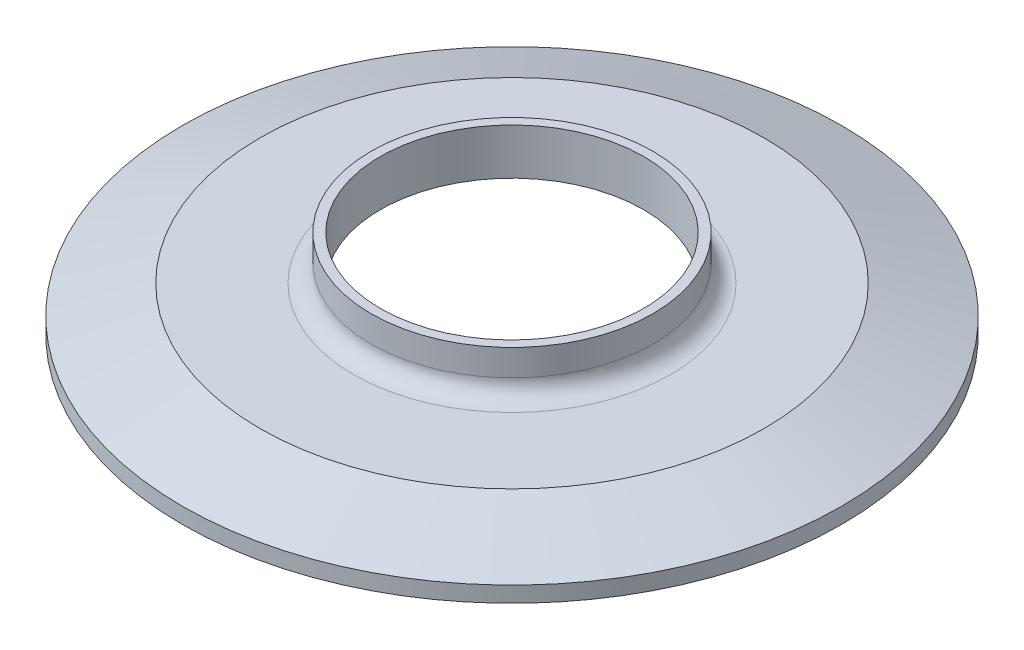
from build123d import *


with BuildPart() as part:
    # Sketch1 → Revolve1 (revolve)
    with BuildSketch(Plane.XY, mode=Mode.PRIVATE) as revolve1_sk:
        with BuildLine():
            Line((-25.4, 15.875), (-25.4, 11.1252))
            ThreePointArc((-25.4, 11.1252), (-26.32993597, 8.88013597), (-28.575, 7.9502))
            Line((-28.575, 7.9502), (-45.434428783, 7.9502))
            Line((-45.434428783, 7.9502), (-59.4614, 2.8448))
            Line((-59.4614, 2.8448), (-59.4614, 0))
            Line((-59.4614, 0), (-56.92485771, 0))
            ThreePointArc((-56.92485771, 0), (-56.416561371, 0.086556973), (-56.070800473, 0.469057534))
            Line((-56.070800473, 0.469057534), (-55.899398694, 0.872854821))
            ThreePointArc((-55.899398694, 0.872854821), (-54.8005, 1.6002), (-53.701601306, 0.872854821))
            Line((-53.701601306, 0.872854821), (-53.534733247, 0.479738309))
            ThreePointArc((-53.534733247, 0.479738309), (-53.244522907, 0.130798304), (-52.809927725, 0))
            Line((-52.809927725, 0), (-48.6918, 0))
            Line((-48.6918, 0), (-23.749, 7.563938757))
            Line((-23.749, 7.563938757), (-23.749, 15.875))
            Line((-23.749, 15.875), (-25.4, 15.875))
        make_face()
    revolve(revolve1_sk.sketch.rotate(Axis((0, 0, 0), (0, 1, 0)), 270), axis=Axis((0, 0, 0), (0, 1, 0)))


solid = part.part
